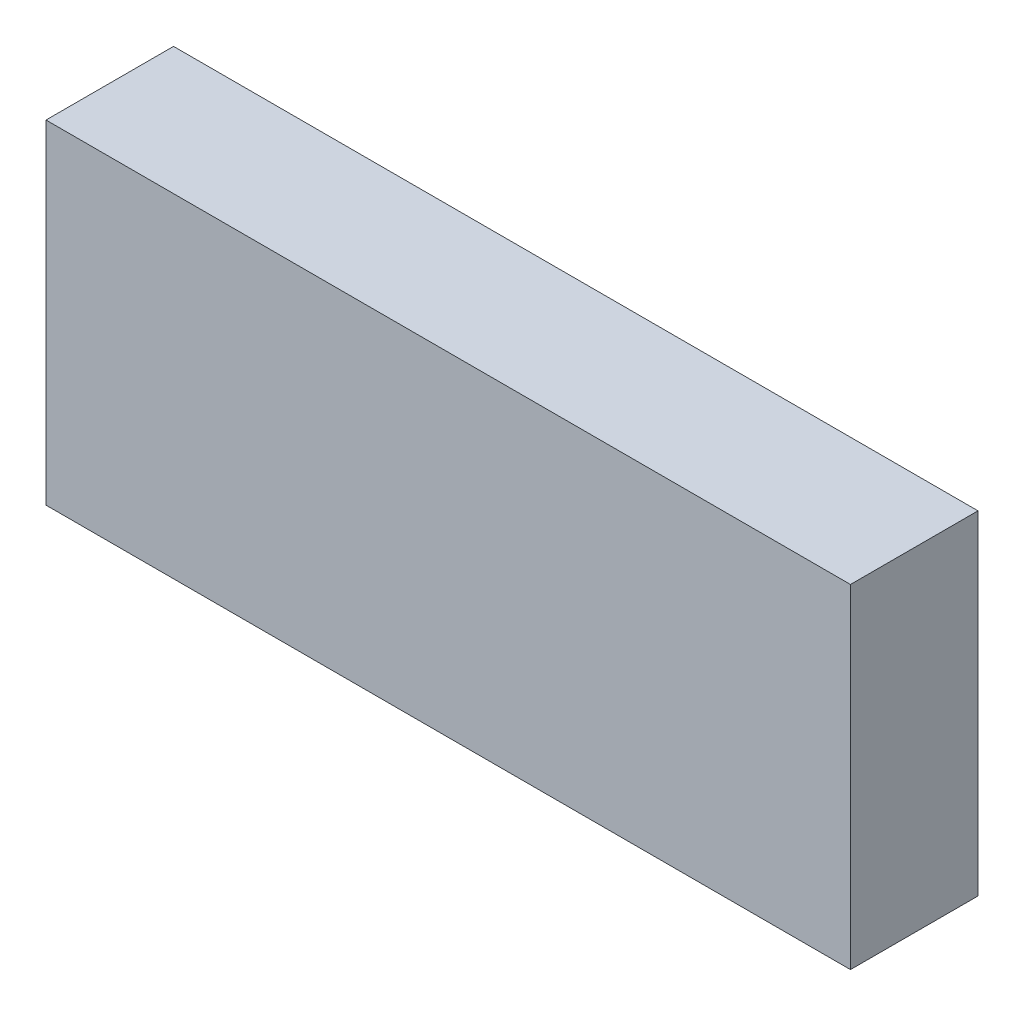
ISO-10303-21;
HEADER;
FILE_DESCRIPTION(('STEP AP214'),'2;1');
FILE_NAME('part.step','',(''),(''),'','','');
FILE_SCHEMA(('AUTOMOTIVE_DESIGN { 1 0 10303 214 1 1 1 1 }'));
ENDSEC;
DATA;
#1=APPLICATION_CONTEXT('core data for automotive mechanical design processes');
#2=APPLICATION_PROTOCOL_DEFINITION('international standard','automotive_design',2000,#1);
#3=PRODUCT_CONTEXT('',#1,'mechanical');
#4=PRODUCT('Part','Part','',(#3));
#5=PRODUCT_RELATED_PRODUCT_CATEGORY('part','',(#4));
#6=PRODUCT_DEFINITION_FORMATION('','',#4);
#7=PRODUCT_DEFINITION_CONTEXT('part definition',#1,'design');
#8=PRODUCT_DEFINITION('design','',#6,#7);
#9=PRODUCT_DEFINITION_SHAPE('','',#8);
#10=(LENGTH_UNIT() NAMED_UNIT(*) SI_UNIT(.MILLI.,.METRE.));
#11=(NAMED_UNIT(*) PLANE_ANGLE_UNIT() SI_UNIT($,.RADIAN.));
#12=(NAMED_UNIT(*) SI_UNIT($,.STERADIAN.) SOLID_ANGLE_UNIT());
#13=UNCERTAINTY_MEASURE_WITH_UNIT(LENGTH_MEASURE(1.E-05),#10,'distance_accuracy_value','');
#14=(GEOMETRIC_REPRESENTATION_CONTEXT(3) GLOBAL_UNCERTAINTY_ASSIGNED_CONTEXT((#13)) GLOBAL_UNIT_ASSIGNED_CONTEXT((#10,
#11,#12)) REPRESENTATION_CONTEXT('',''));
#15=CARTESIAN_POINT('',(0.,0.,0.));
#16=DIRECTION('',(0.,0.,1.));
#17=DIRECTION('',(1.,0.,0.));
#18=AXIS2_PLACEMENT_3D('',#15,#16,#17);
#19=CARTESIAN_POINT('',(-2.04999844,-0.8499983,0.65000124));
#20=DIRECTION('',(0.,0.,-1.));
#21=DIRECTION('',(-1.,0.,0.));
#22=AXIS2_PLACEMENT_3D('',#19,#20,#21);
#23=PLANE('',#22);
#24=DIRECTION('',(0.,1.,0.));
#25=VECTOR('',#24,1.);
#26=CARTESIAN_POINT('',(2.05000098,-0.8499983,0.65000124));
#27=LINE('',#26,#25);
#28=CARTESIAN_POINT('',(2.05000098,-0.8499983,0.65000124));
#29=VERTEX_POINT('',#28);
#30=CARTESIAN_POINT('',(2.05000098,0.85000084,0.65000124));
#31=VERTEX_POINT('',#30);
#32=EDGE_CURVE('E54',#29,#31,#27,.T.);
#33=ORIENTED_EDGE('',*,*,#32,.T.);
#34=DIRECTION('',(1.,0.,0.));
#35=VECTOR('',#34,1.);
#36=CARTESIAN_POINT('',(2.05000098,0.85000084,0.65000124));
#37=LINE('',#36,#35);
#38=CARTESIAN_POINT('',(-2.04999844,0.85000084,0.65000124));
#39=VERTEX_POINT('',#38);
#40=EDGE_CURVE('E56',#31,#39,#37,.F.);
#41=ORIENTED_EDGE('',*,*,#40,.T.);
#42=DIRECTION('',(0.,1.,0.));
#43=VECTOR('',#42,1.);
#44=CARTESIAN_POINT('',(-2.04999844,0.85000084,0.65000124));
#45=LINE('',#44,#43);
#46=CARTESIAN_POINT('',(-2.04999844,-0.8499983,0.65000124));
#47=VERTEX_POINT('',#46);
#48=EDGE_CURVE('E19',#39,#47,#45,.F.);
#49=ORIENTED_EDGE('',*,*,#48,.T.);
#50=DIRECTION('',(1.,0.,0.));
#51=VECTOR('',#50,1.);
#52=CARTESIAN_POINT('',(-2.04999844,-0.8499983,0.65000124));
#53=LINE('',#52,#51);
#54=EDGE_CURVE('E79',#47,#29,#53,.T.);
#55=ORIENTED_EDGE('',*,*,#54,.T.);
#56=EDGE_LOOP('',(#33,#41,#49,#55));
#57=FACE_BOUND('',#56,.T.);
#58=ADVANCED_FACE('F16',(#57),#23,.F.);
#59=CARTESIAN_POINT('',(-2.04999844,0.85000084,0.));
#60=DIRECTION('',(1.,0.,0.));
#61=DIRECTION('',(0.,0.,-1.));
#62=AXIS2_PLACEMENT_3D('',#59,#60,#61);
#63=PLANE('',#62);
#64=DIRECTION('',(0.,0.,1.));
#65=VECTOR('',#64,1.);
#66=CARTESIAN_POINT('',(-2.04999844,-0.8499983,0.));
#67=LINE('',#66,#65);
#68=CARTESIAN_POINT('',(-2.04999844,-0.8499983,0.));
#69=VERTEX_POINT('',#68);
#70=EDGE_CURVE('E67',#69,#47,#67,.T.);
#71=ORIENTED_EDGE('',*,*,#70,.T.);
#72=ORIENTED_EDGE('',*,*,#48,.F.);
#73=DIRECTION('',(0.,0.,-1.));
#74=VECTOR('',#73,1.);
#75=CARTESIAN_POINT('',(-2.04999844,0.85000084,0.));
#76=LINE('',#75,#74);
#77=CARTESIAN_POINT('',(-2.04999844,0.85000084,0.));
#78=VERTEX_POINT('',#77);
#79=EDGE_CURVE('E62',#39,#78,#76,.T.);
#80=ORIENTED_EDGE('',*,*,#79,.T.);
#81=DIRECTION('',(0.,1.,0.));
#82=VECTOR('',#81,1.);
#83=CARTESIAN_POINT('',(-2.04999844,-0.8499983,0.));
#84=LINE('',#83,#82);
#85=EDGE_CURVE('E82',#69,#78,#84,.T.);
#86=ORIENTED_EDGE('',*,*,#85,.F.);
#87=EDGE_LOOP('',(#71,#72,#80,#86));
#88=FACE_BOUND('',#87,.T.);
#89=ADVANCED_FACE('F64',(#88),#63,.F.);
#90=CARTESIAN_POINT('',(2.05000098,0.85000084,0.));
#91=DIRECTION('',(0.,-1.,0.));
#92=DIRECTION('',(0.,0.,-1.));
#93=AXIS2_PLACEMENT_3D('',#90,#91,#92);
#94=PLANE('',#93);
#95=ORIENTED_EDGE('',*,*,#79,.F.);
#96=ORIENTED_EDGE('',*,*,#40,.F.);
#97=DIRECTION('',(0.,0.,1.));
#98=VECTOR('',#97,1.);
#99=CARTESIAN_POINT('',(2.05000098,0.85000084,0.));
#100=LINE('',#99,#98);
#101=CARTESIAN_POINT('',(2.05000098,0.85000084,0.));
#102=VERTEX_POINT('',#101);
#103=EDGE_CURVE('E74',#31,#102,#100,.F.);
#104=ORIENTED_EDGE('',*,*,#103,.T.);
#105=DIRECTION('',(-1.,0.,0.));
#106=VECTOR('',#105,1.);
#107=CARTESIAN_POINT('',(-2.04999844,0.85000084,0.));
#108=LINE('',#107,#106);
#109=EDGE_CURVE('E71',#78,#102,#108,.F.);
#110=ORIENTED_EDGE('',*,*,#109,.F.);
#111=EDGE_LOOP('',(#95,#96,#104,#110));
#112=FACE_BOUND('',#111,.T.);
#113=ADVANCED_FACE('F69',(#112),#94,.F.);
#114=CARTESIAN_POINT('',(2.05000098,-0.8499983,0.));
#115=DIRECTION('',(-1.,0.,0.));
#116=DIRECTION('',(0.,0.,1.));
#117=AXIS2_PLACEMENT_3D('',#114,#115,#116);
#118=PLANE('',#117);
#119=ORIENTED_EDGE('',*,*,#103,.F.);
#120=ORIENTED_EDGE('',*,*,#32,.F.);
#121=DIRECTION('',(0.,0.,1.));
#122=VECTOR('',#121,1.);
#123=CARTESIAN_POINT('',(2.05000098,-0.8499983,0.));
#124=LINE('',#123,#122);
#125=CARTESIAN_POINT('',(2.05000098,-0.8499983,0.));
#126=VERTEX_POINT('',#125);
#127=EDGE_CURVE('E34',#29,#126,#124,.F.);
#128=ORIENTED_EDGE('',*,*,#127,.T.);
#129=DIRECTION('',(0.,1.,0.));
#130=VECTOR('',#129,1.);
#131=CARTESIAN_POINT('',(2.05000098,-0.8499983,0.));
#132=LINE('',#131,#130);
#133=EDGE_CURVE('E25',#102,#126,#132,.F.);
#134=ORIENTED_EDGE('',*,*,#133,.F.);
#135=EDGE_LOOP('',(#119,#120,#128,#134));
#136=FACE_BOUND('',#135,.T.);
#137=ADVANCED_FACE('F88',(#136),#118,.F.);
#138=CARTESIAN_POINT('',(-2.04999844,-0.8499983,0.));
#139=DIRECTION('',(0.,1.,0.));
#140=DIRECTION('',(0.,0.,1.));
#141=AXIS2_PLACEMENT_3D('',#138,#139,#140);
#142=PLANE('',#141);
#143=ORIENTED_EDGE('',*,*,#127,.F.);
#144=ORIENTED_EDGE('',*,*,#54,.F.);
#145=ORIENTED_EDGE('',*,*,#70,.F.);
#146=DIRECTION('',(-1.,0.,0.));
#147=VECTOR('',#146,1.);
#148=CARTESIAN_POINT('',(-2.04999844,-0.8499983,0.));
#149=LINE('',#148,#147);
#150=EDGE_CURVE('E11',#126,#69,#149,.T.);
#151=ORIENTED_EDGE('',*,*,#150,.F.);
#152=EDGE_LOOP('',(#143,#144,#145,#151));
#153=FACE_BOUND('',#152,.T.);
#154=ADVANCED_FACE('F90',(#153),#142,.F.);
#155=CARTESIAN_POINT('',(-2.04999844,-0.8499983,0.));
#156=DIRECTION('',(0.,0.,-1.));
#157=DIRECTION('',(-1.,0.,0.));
#158=AXIS2_PLACEMENT_3D('',#155,#156,#157);
#159=PLANE('',#158);
#160=ORIENTED_EDGE('',*,*,#133,.T.);
#161=ORIENTED_EDGE('',*,*,#150,.T.);
#162=ORIENTED_EDGE('',*,*,#85,.T.);
#163=ORIENTED_EDGE('',*,*,#109,.T.);
#164=EDGE_LOOP('',(#160,#161,#162,#163));
#165=FACE_BOUND('',#164,.T.);
#166=ADVANCED_FACE('F87',(#165),#159,.T.);
#167=CLOSED_SHELL('',(#58,#89,#113,#137,#154,#166));
#168=MANIFOLD_SOLID_BREP('B1',#167);
#169=ADVANCED_BREP_SHAPE_REPRESENTATION('',(#18,#168),#14);
#170=SHAPE_DEFINITION_REPRESENTATION(#9,#169);
ENDSEC;
END-ISO-10303-21;
